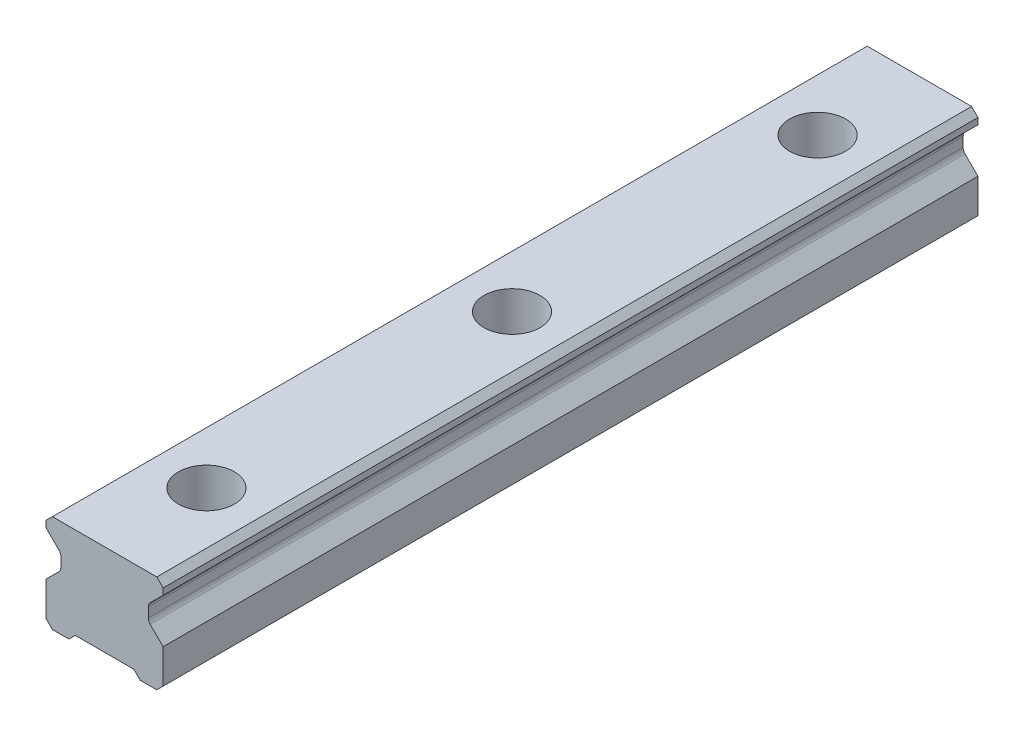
ISO-10303-21;
HEADER;
FILE_DESCRIPTION(('STEP AP214'),'2;1');
FILE_NAME('part.step','',(''),(''),'','','');
FILE_SCHEMA(('AUTOMOTIVE_DESIGN { 1 0 10303 214 1 1 1 1 }'));
ENDSEC;
DATA;
#1=APPLICATION_CONTEXT('core data for automotive mechanical design processes');
#2=APPLICATION_PROTOCOL_DEFINITION('international standard','automotive_design',2000,#1);
#3=PRODUCT_CONTEXT('',#1,'mechanical');
#4=PRODUCT('Part','Part','',(#3));
#5=PRODUCT_RELATED_PRODUCT_CATEGORY('part','',(#4));
#6=PRODUCT_DEFINITION_FORMATION('','',#4);
#7=PRODUCT_DEFINITION_CONTEXT('part definition',#1,'design');
#8=PRODUCT_DEFINITION('design','',#6,#7);
#9=PRODUCT_DEFINITION_SHAPE('','',#8);
#10=(LENGTH_UNIT() NAMED_UNIT(*) SI_UNIT(.MILLI.,.METRE.));
#11=(NAMED_UNIT(*) PLANE_ANGLE_UNIT() SI_UNIT($,.RADIAN.));
#12=(NAMED_UNIT(*) SI_UNIT($,.STERADIAN.) SOLID_ANGLE_UNIT());
#13=UNCERTAINTY_MEASURE_WITH_UNIT(LENGTH_MEASURE(1.E-05),#10,'distance_accuracy_value','');
#14=(GEOMETRIC_REPRESENTATION_CONTEXT(3) GLOBAL_UNCERTAINTY_ASSIGNED_CONTEXT((#13)) GLOBAL_UNIT_ASSIGNED_CONTEXT((#10,
#11,#12)) REPRESENTATION_CONTEXT('',''));
#15=CARTESIAN_POINT('',(0.,0.,0.));
#16=DIRECTION('',(0.,0.,1.));
#17=DIRECTION('',(1.,0.,0.));
#18=AXIS2_PLACEMENT_3D('',#15,#16,#17);
#19=CARTESIAN_POINT('',(0.,10.2,-60.));
#20=DIRECTION('',(0.,1.,0.));
#21=DIRECTION('',(0.,0.,1.));
#22=AXIS2_PLACEMENT_3D('',#19,#20,#21);
#23=PLANE('',#22);
#24=CARTESIAN_POINT('',(0.,10.2,-60.));
#25=DIRECTION('',(0.,1.,0.));
#26=DIRECTION('',(0.,0.,1.));
#27=AXIS2_PLACEMENT_3D('',#24,#25,#26);
#28=CIRCLE('',#27,3.5);
#29=CARTESIAN_POINT('',(0.,10.2,-56.5));
#30=VERTEX_POINT('',#29);
#31=EDGE_CURVE('E369',#30,#30,#28,.T.);
#32=ORIENTED_EDGE('',*,*,#31,.F.);
#33=EDGE_LOOP('',(#32));
#34=FACE_BOUND('',#33,.T.);
#35=CARTESIAN_POINT('',(0.,10.2,-60.));
#36=DIRECTION('',(0.,1.,0.));
#37=DIRECTION('',(0.,0.,1.));
#38=AXIS2_PLACEMENT_3D('',#35,#36,#37);
#39=CIRCLE('',#38,5.5);
#40=CARTESIAN_POINT('',(0.,10.2,-54.5));
#41=VERTEX_POINT('',#40);
#42=EDGE_CURVE('E11',#41,#41,#39,.T.);
#43=ORIENTED_EDGE('',*,*,#42,.T.);
#44=EDGE_LOOP('',(#43));
#45=FACE_BOUND('',#44,.T.);
#46=ADVANCED_FACE('F39',(#34,#45),#23,.T.);
#47=CARTESIAN_POINT('',(0.,10.2,-60.));
#48=DIRECTION('',(0.,1.,0.));
#49=DIRECTION('',(0.,0.,1.));
#50=AXIS2_PLACEMENT_3D('',#47,#48,#49);
#51=CYLINDRICAL_SURFACE('',#50,5.5);
#52=ORIENTED_EDGE('',*,*,#42,.F.);
#53=EDGE_LOOP('',(#52));
#54=FACE_BOUND('',#53,.T.);
#55=CARTESIAN_POINT('',(0.,19.2,-60.));
#56=DIRECTION('',(0.,1.,0.));
#57=DIRECTION('',(0.,0.,1.));
#58=AXIS2_PLACEMENT_3D('',#55,#56,#57);
#59=CIRCLE('',#58,5.5);
#60=CARTESIAN_POINT('',(0.,19.2,-54.5));
#61=VERTEX_POINT('',#60);
#62=EDGE_CURVE('E48',#61,#61,#59,.T.);
#63=ORIENTED_EDGE('',*,*,#62,.T.);
#64=EDGE_LOOP('',(#63));
#65=FACE_BOUND('',#64,.T.);
#66=ADVANCED_FACE('F556',(#54,#65),#51,.F.);
#67=CARTESIAN_POINT('',(11.5,0.,80.));
#68=DIRECTION('',(0.,1.,0.));
#69=DIRECTION('',(-1.,0.,0.));
#70=AXIS2_PLACEMENT_3D('',#67,#68,#69);
#71=PLANE('',#70);
#72=DIRECTION('',(1.,0.,0.));
#73=VECTOR('',#72,1.);
#74=CARTESIAN_POINT('',(11.5,0.,-80.));
#75=LINE('',#74,#73);
#76=CARTESIAN_POINT('',(-10.25,0.,-80.));
#77=VERTEX_POINT('',#76);
#78=CARTESIAN_POINT('',(-7.,0.,-80.));
#79=VERTEX_POINT('',#78);
#80=EDGE_CURVE('E229',#77,#79,#75,.T.);
#81=ORIENTED_EDGE('',*,*,#80,.T.);
#82=DIRECTION('',(0.,0.,1.));
#83=VECTOR('',#82,1.);
#84=CARTESIAN_POINT('',(-7.,0.,-80.));
#85=LINE('',#84,#83);
#86=CARTESIAN_POINT('',(-7.,0.,80.));
#87=VERTEX_POINT('',#86);
#88=EDGE_CURVE('E411',#79,#87,#85,.T.);
#89=ORIENTED_EDGE('',*,*,#88,.T.);
#90=DIRECTION('',(1.,0.,0.));
#91=VECTOR('',#90,1.);
#92=CARTESIAN_POINT('',(11.5,0.,80.));
#93=LINE('',#92,#91);
#94=CARTESIAN_POINT('',(-10.25,0.,80.));
#95=VERTEX_POINT('',#94);
#96=EDGE_CURVE('E481',#95,#87,#93,.T.);
#97=ORIENTED_EDGE('',*,*,#96,.F.);
#98=DIRECTION('',(0.,0.,-1.));
#99=VECTOR('',#98,1.);
#100=CARTESIAN_POINT('',(-10.25,0.,80.));
#101=LINE('',#100,#99);
#102=EDGE_CURVE('E289',#95,#77,#101,.T.);
#103=ORIENTED_EDGE('',*,*,#102,.T.);
#104=EDGE_LOOP('',(#81,#89,#97,#103));
#105=FACE_BOUND('',#104,.T.);
#106=ADVANCED_FACE('F558',(#105),#71,.F.);
#107=CARTESIAN_POINT('',(-11.5,19.2,80.));
#108=DIRECTION('',(1.,0.,0.));
#109=DIRECTION('',(0.,1.,0.));
#110=AXIS2_PLACEMENT_3D('',#107,#108,#109);
#111=PLANE('',#110);
#112=DIRECTION('',(0.,-1.,0.));
#113=VECTOR('',#112,1.);
#114=CARTESIAN_POINT('',(-11.5,19.2,80.));
#115=LINE('',#114,#113);
#116=CARTESIAN_POINT('',(-11.5,17.95,80.));
#117=VERTEX_POINT('',#116);
#118=CARTESIAN_POINT('',(-11.5,16.7,80.));
#119=VERTEX_POINT('',#118);
#120=EDGE_CURVE('E477',#117,#119,#115,.T.);
#121=ORIENTED_EDGE('',*,*,#120,.F.);
#122=DIRECTION('',(0.,0.,-1.));
#123=VECTOR('',#122,1.);
#124=CARTESIAN_POINT('',(-11.5,17.95,80.));
#125=LINE('',#124,#123);
#126=CARTESIAN_POINT('',(-11.5,17.95,-80.));
#127=VERTEX_POINT('',#126);
#128=EDGE_CURVE('E252',#117,#127,#125,.T.);
#129=ORIENTED_EDGE('',*,*,#128,.T.);
#130=DIRECTION('',(0.,-1.,0.));
#131=VECTOR('',#130,1.);
#132=CARTESIAN_POINT('',(-11.5,19.2,-80.));
#133=LINE('',#132,#131);
#134=CARTESIAN_POINT('',(-11.5,16.7,-80.));
#135=VERTEX_POINT('',#134);
#136=EDGE_CURVE('E230',#127,#135,#133,.T.);
#137=ORIENTED_EDGE('',*,*,#136,.T.);
#138=DIRECTION('',(0.,0.,1.));
#139=VECTOR('',#138,1.);
#140=CARTESIAN_POINT('',(-11.5,16.7,-80.));
#141=LINE('',#140,#139);
#142=EDGE_CURVE('E432',#135,#119,#141,.T.);
#143=ORIENTED_EDGE('',*,*,#142,.T.);
#144=EDGE_LOOP('',(#121,#129,#137,#143));
#145=FACE_BOUND('',#144,.T.);
#146=ADVANCED_FACE('F507',(#145),#111,.F.);
#147=CARTESIAN_POINT('',(11.5,19.2,80.));
#148=DIRECTION('',(-1.,0.,0.));
#149=DIRECTION('',(0.,0.,1.));
#150=AXIS2_PLACEMENT_3D('',#147,#148,#149);
#151=PLANE('',#150);
#152=DIRECTION('',(0.,1.,0.));
#153=VECTOR('',#152,1.);
#154=CARTESIAN_POINT('',(11.5,19.2,80.));
#155=LINE('',#154,#153);
#156=CARTESIAN_POINT('',(11.5,1.25,80.));
#157=VERTEX_POINT('',#156);
#158=CARTESIAN_POINT('',(11.5,7.95,80.));
#159=VERTEX_POINT('',#158);
#160=EDGE_CURVE('E486',#157,#159,#155,.T.);
#161=ORIENTED_EDGE('',*,*,#160,.F.);
#162=DIRECTION('',(0.,0.,-1.));
#163=VECTOR('',#162,1.);
#164=CARTESIAN_POINT('',(11.5,1.25,80.));
#165=LINE('',#164,#163);
#166=CARTESIAN_POINT('',(11.5,1.25,-80.));
#167=VERTEX_POINT('',#166);
#168=EDGE_CURVE('E296',#157,#167,#165,.T.);
#169=ORIENTED_EDGE('',*,*,#168,.T.);
#170=DIRECTION('',(0.,1.,0.));
#171=VECTOR('',#170,1.);
#172=CARTESIAN_POINT('',(11.5,19.2,-80.));
#173=LINE('',#172,#171);
#174=CARTESIAN_POINT('',(11.5,7.95,-80.));
#175=VERTEX_POINT('',#174);
#176=EDGE_CURVE('E243',#167,#175,#173,.T.);
#177=ORIENTED_EDGE('',*,*,#176,.T.);
#178=DIRECTION('',(0.,0.,1.));
#179=VECTOR('',#178,1.);
#180=CARTESIAN_POINT('',(11.5,7.95,-80.));
#181=LINE('',#180,#179);
#182=EDGE_CURVE('E462',#175,#159,#181,.T.);
#183=ORIENTED_EDGE('',*,*,#182,.T.);
#184=EDGE_LOOP('',(#161,#169,#177,#183));
#185=FACE_BOUND('',#184,.T.);
#186=ADVANCED_FACE('F595',(#185),#151,.F.);
#187=CARTESIAN_POINT('',(-11.5,7.95,-80.));
#188=VERTEX_POINT('',#187);
#189=CARTESIAN_POINT('',(-11.5,1.24999999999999,-80.));
#190=VERTEX_POINT('',#189);
#191=EDGE_CURVE('E239',#188,#190,#133,.T.);
#192=ORIENTED_EDGE('',*,*,#191,.T.);
#193=DIRECTION('',(0.,0.,1.));
#194=VECTOR('',#193,1.);
#195=CARTESIAN_POINT('',(-11.5,1.24999999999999,80.));
#196=LINE('',#195,#194);
#197=CARTESIAN_POINT('',(-11.5,1.24999999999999,80.));
#198=VERTEX_POINT('',#197);
#199=EDGE_CURVE('E293',#190,#198,#196,.T.);
#200=ORIENTED_EDGE('',*,*,#199,.T.);
#201=CARTESIAN_POINT('',(-11.5,7.95,80.));
#202=VERTEX_POINT('',#201);
#203=EDGE_CURVE('E251',#202,#198,#115,.T.);
#204=ORIENTED_EDGE('',*,*,#203,.F.);
#205=DIRECTION('',(0.,0.,1.));
#206=VECTOR('',#205,1.);
#207=CARTESIAN_POINT('',(-11.5,7.95,-80.));
#208=LINE('',#207,#206);
#209=EDGE_CURVE('E444',#188,#202,#208,.T.);
#210=ORIENTED_EDGE('',*,*,#209,.F.);
#211=EDGE_LOOP('',(#192,#200,#204,#210));
#212=FACE_BOUND('',#211,.T.);
#213=ADVANCED_FACE('F535',(#212),#111,.F.);
#214=CARTESIAN_POINT('',(7.,0.,80.));
#215=VERTEX_POINT('',#214);
#216=CARTESIAN_POINT('',(10.25,0.,80.));
#217=VERTEX_POINT('',#216);
#218=EDGE_CURVE('E219',#215,#217,#93,.T.);
#219=ORIENTED_EDGE('',*,*,#218,.F.);
#220=DIRECTION('',(0.,0.,1.));
#221=VECTOR('',#220,1.);
#222=CARTESIAN_POINT('',(7.,0.,-80.));
#223=LINE('',#222,#221);
#224=CARTESIAN_POINT('',(7.,0.,-80.));
#225=VERTEX_POINT('',#224);
#226=EDGE_CURVE('E206',#225,#215,#223,.T.);
#227=ORIENTED_EDGE('',*,*,#226,.F.);
#228=CARTESIAN_POINT('',(10.25,0.,-80.));
#229=VERTEX_POINT('',#228);
#230=EDGE_CURVE('E217',#225,#229,#75,.T.);
#231=ORIENTED_EDGE('',*,*,#230,.T.);
#232=DIRECTION('',(0.,0.,1.));
#233=VECTOR('',#232,1.);
#234=CARTESIAN_POINT('',(10.25,0.,80.));
#235=LINE('',#234,#233);
#236=EDGE_CURVE('E286',#229,#217,#235,.T.);
#237=ORIENTED_EDGE('',*,*,#236,.T.);
#238=EDGE_LOOP('',(#219,#227,#231,#237));
#239=FACE_BOUND('',#238,.T.);
#240=ADVANCED_FACE('F215',(#239),#71,.F.);
#241=CARTESIAN_POINT('',(11.5,16.7,-80.));
#242=VERTEX_POINT('',#241);
#243=CARTESIAN_POINT('',(11.5,17.95,-80.));
#244=VERTEX_POINT('',#243);
#245=EDGE_CURVE('E236',#242,#244,#173,.T.);
#246=ORIENTED_EDGE('',*,*,#245,.T.);
#247=DIRECTION('',(0.,0.,1.));
#248=VECTOR('',#247,1.);
#249=CARTESIAN_POINT('',(11.5,17.95,80.));
#250=LINE('',#249,#248);
#251=CARTESIAN_POINT('',(11.5,17.95,80.));
#252=VERTEX_POINT('',#251);
#253=EDGE_CURVE('E300',#244,#252,#250,.T.);
#254=ORIENTED_EDGE('',*,*,#253,.T.);
#255=CARTESIAN_POINT('',(11.5,16.7,80.));
#256=VERTEX_POINT('',#255);
#257=EDGE_CURVE('E485',#256,#252,#155,.T.);
#258=ORIENTED_EDGE('',*,*,#257,.F.);
#259=DIRECTION('',(0.,0.,1.));
#260=VECTOR('',#259,1.);
#261=CARTESIAN_POINT('',(11.5,16.7,-80.));
#262=LINE('',#261,#260);
#263=EDGE_CURVE('E437',#242,#256,#262,.T.);
#264=ORIENTED_EDGE('',*,*,#263,.F.);
#265=EDGE_LOOP('',(#246,#254,#258,#264));
#266=FACE_BOUND('',#265,.T.);
#267=ADVANCED_FACE('F545',(#266),#151,.F.);
#268=CARTESIAN_POINT('',(11.5,19.2,80.));
#269=DIRECTION('',(0.,-1.,0.));
#270=DIRECTION('',(0.,0.,-1.));
#271=AXIS2_PLACEMENT_3D('',#268,#269,#270);
#272=PLANE('',#271);
#273=CARTESIAN_POINT('',(0.,19.2,0.));
#274=DIRECTION('',(0.,1.,0.));
#275=DIRECTION('',(0.,0.,1.));
#276=AXIS2_PLACEMENT_3D('',#273,#274,#275);
#277=CIRCLE('',#276,5.5);
#278=CARTESIAN_POINT('',(0.,19.2,5.5));
#279=VERTEX_POINT('',#278);
#280=EDGE_CURVE('E374',#279,#279,#277,.T.);
#281=ORIENTED_EDGE('',*,*,#280,.F.);
#282=EDGE_LOOP('',(#281));
#283=FACE_BOUND('',#282,.T.);
#284=CARTESIAN_POINT('',(0.,19.2,60.));
#285=DIRECTION('',(0.,1.,0.));
#286=DIRECTION('',(0.,0.,1.));
#287=AXIS2_PLACEMENT_3D('',#284,#285,#286);
#288=CIRCLE('',#287,5.5);
#289=CARTESIAN_POINT('',(0.,19.2,65.5));
#290=VERTEX_POINT('',#289);
#291=EDGE_CURVE('E390',#290,#290,#288,.T.);
#292=ORIENTED_EDGE('',*,*,#291,.F.);
#293=EDGE_LOOP('',(#292));
#294=FACE_BOUND('',#293,.T.);
#295=DIRECTION('',(-1.,0.,0.));
#296=VECTOR('',#295,1.);
#297=CARTESIAN_POINT('',(11.5,19.2,-80.));
#298=LINE('',#297,#296);
#299=CARTESIAN_POINT('',(10.25,19.2,-80.));
#300=VERTEX_POINT('',#299);
#301=CARTESIAN_POINT('',(-10.25,19.2,-80.));
#302=VERTEX_POINT('',#301);
#303=EDGE_CURVE('E247',#300,#302,#298,.T.);
#304=ORIENTED_EDGE('',*,*,#303,.T.);
#305=DIRECTION('',(0.,0.,1.));
#306=VECTOR('',#305,1.);
#307=CARTESIAN_POINT('',(-10.25,19.2,80.));
#308=LINE('',#307,#306);
#309=CARTESIAN_POINT('',(-10.25,19.2,80.));
#310=VERTEX_POINT('',#309);
#311=EDGE_CURVE('E272',#302,#310,#308,.T.);
#312=ORIENTED_EDGE('',*,*,#311,.T.);
#313=DIRECTION('',(-1.,0.,0.));
#314=VECTOR('',#313,1.);
#315=CARTESIAN_POINT('',(11.5,19.2,80.));
#316=LINE('',#315,#314);
#317=CARTESIAN_POINT('',(10.25,19.2,80.));
#318=VERTEX_POINT('',#317);
#319=EDGE_CURVE('E257',#318,#310,#316,.T.);
#320=ORIENTED_EDGE('',*,*,#319,.F.);
#321=DIRECTION('',(0.,0.,-1.));
#322=VECTOR('',#321,1.);
#323=CARTESIAN_POINT('',(10.25,19.2,80.));
#324=LINE('',#323,#322);
#325=EDGE_CURVE('E268',#318,#300,#324,.T.);
#326=ORIENTED_EDGE('',*,*,#325,.T.);
#327=EDGE_LOOP('',(#304,#312,#320,#326));
#328=FACE_BOUND('',#327,.T.);
#329=ORIENTED_EDGE('',*,*,#62,.F.);
#330=EDGE_LOOP('',(#329));
#331=FACE_BOUND('',#330,.T.);
#332=ADVANCED_FACE('F549',(#283,#294,#328,#331),#272,.F.);
#333=CARTESIAN_POINT('',(0.,0.,80.));
#334=DIRECTION('',(0.,0.,-1.));
#335=DIRECTION('',(-1.,0.,0.));
#336=AXIS2_PLACEMENT_3D('',#333,#334,#335);
#337=PLANE('',#336);
#338=ORIENTED_EDGE('',*,*,#96,.T.);
#339=DIRECTION('',(-0.707106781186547,-0.707106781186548,0.));
#340=VECTOR('',#339,1.);
#341=CARTESIAN_POINT('',(-7.,0.,80.));
#342=LINE('',#341,#340);
#343=CARTESIAN_POINT('',(-5.75,1.25,80.));
#344=VERTEX_POINT('',#343);
#345=EDGE_CURVE('E211',#344,#87,#342,.T.);
#346=ORIENTED_EDGE('',*,*,#345,.F.);
#347=DIRECTION('',(-1.,0.,0.));
#348=VECTOR('',#347,1.);
#349=CARTESIAN_POINT('',(-5.75,1.25,80.));
#350=LINE('',#349,#348);
#351=CARTESIAN_POINT('',(5.75,1.25,80.));
#352=VERTEX_POINT('',#351);
#353=EDGE_CURVE('E405',#352,#344,#350,.T.);
#354=ORIENTED_EDGE('',*,*,#353,.F.);
#355=DIRECTION('',(-0.707106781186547,0.707106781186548,0.));
#356=VECTOR('',#355,1.);
#357=CARTESIAN_POINT('',(5.75,1.25,80.));
#358=LINE('',#357,#356);
#359=EDGE_CURVE('E395',#215,#352,#358,.T.);
#360=ORIENTED_EDGE('',*,*,#359,.F.);
#361=ORIENTED_EDGE('',*,*,#218,.T.);
#362=DIRECTION('',(-0.707106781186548,-0.707106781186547,0.));
#363=VECTOR('',#362,1.);
#364=CARTESIAN_POINT('',(11.5,1.25,80.));
#365=LINE('',#364,#363);
#366=EDGE_CURVE('E278',#217,#157,#365,.F.);
#367=ORIENTED_EDGE('',*,*,#366,.T.);
#368=ORIENTED_EDGE('',*,*,#160,.T.);
#369=DIRECTION('',(0.707106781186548,-0.707106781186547,0.));
#370=VECTOR('',#369,1.);
#371=CARTESIAN_POINT('',(11.5,7.95,80.));
#372=LINE('',#371,#370);
#373=CARTESIAN_POINT('',(8.94944985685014,10.5005501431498,80.));
#374=VERTEX_POINT('',#373);
#375=EDGE_CURVE('E415',#374,#159,#372,.T.);
#376=ORIENTED_EDGE('',*,*,#375,.F.);
#377=CARTESIAN_POINT('',(9.83333333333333,11.384433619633,80.));
#378=DIRECTION('',(0.,0.,-1.));
#379=DIRECTION('',(-1.,0.,0.));
#380=AXIS2_PLACEMENT_3D('',#377,#378,#379);
#381=CIRCLE('',#380,1.25);
#382=CARTESIAN_POINT('',(8.58333333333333,11.384433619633,80.));
#383=VERTEX_POINT('',#382);
#384=EDGE_CURVE('E331',#374,#383,#381,.T.);
#385=ORIENTED_EDGE('',*,*,#384,.T.);
#386=DIRECTION('',(0.,-1.,0.));
#387=VECTOR('',#386,1.);
#388=CARTESIAN_POINT('',(8.58333333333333,10.8666666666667,80.));
#389=LINE('',#388,#387);
#390=CARTESIAN_POINT('',(8.58333333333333,13.265566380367,80.));
#391=VERTEX_POINT('',#390);
#392=EDGE_CURVE('E454',#391,#383,#389,.T.);
#393=ORIENTED_EDGE('',*,*,#392,.F.);
#394=CARTESIAN_POINT('',(9.83333333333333,13.265566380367,80.));
#395=DIRECTION('',(0.,0.,-1.));
#396=DIRECTION('',(-1.,0.,0.));
#397=AXIS2_PLACEMENT_3D('',#394,#395,#396);
#398=CIRCLE('',#397,1.25);
#399=CARTESIAN_POINT('',(8.94944985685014,14.1494498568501,80.));
#400=VERTEX_POINT('',#399);
#401=EDGE_CURVE('E337',#391,#400,#398,.T.);
#402=ORIENTED_EDGE('',*,*,#401,.T.);
#403=DIRECTION('',(-0.707106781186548,-0.707106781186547,0.));
#404=VECTOR('',#403,1.);
#405=CARTESIAN_POINT('',(8.58333333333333,13.7833333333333,80.));
#406=LINE('',#405,#404);
#407=EDGE_CURVE('E465',#256,#400,#406,.T.);
#408=ORIENTED_EDGE('',*,*,#407,.F.);
#409=ORIENTED_EDGE('',*,*,#257,.T.);
#410=DIRECTION('',(0.707106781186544,-0.707106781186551,0.));
#411=VECTOR('',#410,1.);
#412=CARTESIAN_POINT('',(10.25,19.2,80.));
#413=LINE('',#412,#411);
#414=EDGE_CURVE('E275',#252,#318,#413,.F.);
#415=ORIENTED_EDGE('',*,*,#414,.T.);
#416=ORIENTED_EDGE('',*,*,#319,.T.);
#417=DIRECTION('',(0.707106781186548,0.707106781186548,0.));
#418=VECTOR('',#417,1.);
#419=CARTESIAN_POINT('',(-11.5,17.95,80.));
#420=LINE('',#419,#418);
#421=EDGE_CURVE('E284',#310,#117,#420,.F.);
#422=ORIENTED_EDGE('',*,*,#421,.T.);
#423=ORIENTED_EDGE('',*,*,#120,.T.);
#424=DIRECTION('',(-0.707106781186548,0.707106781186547,0.));
#425=VECTOR('',#424,1.);
#426=CARTESIAN_POINT('',(-8.58333333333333,13.7833333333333,80.));
#427=LINE('',#426,#425);
#428=CARTESIAN_POINT('',(-8.94944985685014,14.1494498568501,80.));
#429=VERTEX_POINT('',#428);
#430=EDGE_CURVE('E433',#429,#119,#427,.T.);
#431=ORIENTED_EDGE('',*,*,#430,.F.);
#432=CARTESIAN_POINT('',(-9.83333333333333,13.265566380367,80.));
#433=DIRECTION('',(0.,0.,-1.));
#434=DIRECTION('',(-1.,0.,0.));
#435=AXIS2_PLACEMENT_3D('',#432,#433,#434);
#436=CIRCLE('',#435,1.25);
#437=CARTESIAN_POINT('',(-8.58333333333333,13.265566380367,80.));
#438=VERTEX_POINT('',#437);
#439=EDGE_CURVE('E349',#429,#438,#436,.T.);
#440=ORIENTED_EDGE('',*,*,#439,.T.);
#441=DIRECTION('',(0.,1.,0.));
#442=VECTOR('',#441,1.);
#443=CARTESIAN_POINT('',(-8.58333333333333,10.8666666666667,80.));
#444=LINE('',#443,#442);
#445=CARTESIAN_POINT('',(-8.58333333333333,11.384433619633,80.));
#446=VERTEX_POINT('',#445);
#447=EDGE_CURVE('E425',#446,#438,#444,.T.);
#448=ORIENTED_EDGE('',*,*,#447,.F.);
#449=CARTESIAN_POINT('',(-9.83333333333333,11.384433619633,80.));
#450=DIRECTION('',(0.,0.,-1.));
#451=DIRECTION('',(-1.,0.,0.));
#452=AXIS2_PLACEMENT_3D('',#449,#450,#451);
#453=CIRCLE('',#452,1.25);
#454=CARTESIAN_POINT('',(-8.94944985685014,10.5005501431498,80.));
#455=VERTEX_POINT('',#454);
#456=EDGE_CURVE('E343',#446,#455,#453,.T.);
#457=ORIENTED_EDGE('',*,*,#456,.T.);
#458=DIRECTION('',(0.707106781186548,0.707106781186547,0.));
#459=VECTOR('',#458,1.);
#460=CARTESIAN_POINT('',(-11.5,7.95,80.));
#461=LINE('',#460,#459);
#462=EDGE_CURVE('E436',#202,#455,#461,.T.);
#463=ORIENTED_EDGE('',*,*,#462,.F.);
#464=ORIENTED_EDGE('',*,*,#203,.T.);
#465=DIRECTION('',(-0.707106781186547,0.707106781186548,0.));
#466=VECTOR('',#465,1.);
#467=CARTESIAN_POINT('',(-10.25,0.,80.));
#468=LINE('',#467,#466);
#469=EDGE_CURVE('E281',#198,#95,#468,.F.);
#470=ORIENTED_EDGE('',*,*,#469,.T.);
#471=EDGE_LOOP('',(#338,#346,#354,#360,#361,#367,#368,#376,#385,#393,#402,#408,#409,#415,#416,
#422,#423,#431,#440,#448,#457,#463,#464,#470));
#472=FACE_BOUND('',#471,.T.);
#473=ADVANCED_FACE('F495',(#472),#337,.F.);
#474=CARTESIAN_POINT('',(0.,0.,-80.));
#475=DIRECTION('',(0.,0.,-1.));
#476=DIRECTION('',(-1.,0.,0.));
#477=AXIS2_PLACEMENT_3D('',#474,#475,#476);
#478=PLANE('',#477);
#479=DIRECTION('',(-0.707106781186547,-0.707106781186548,0.));
#480=VECTOR('',#479,1.);
#481=CARTESIAN_POINT('',(-7.,0.,-80.));
#482=LINE('',#481,#480);
#483=CARTESIAN_POINT('',(-5.75,1.25,-80.));
#484=VERTEX_POINT('',#483);
#485=EDGE_CURVE('E221',#484,#79,#482,.T.);
#486=ORIENTED_EDGE('',*,*,#485,.T.);
#487=ORIENTED_EDGE('',*,*,#80,.F.);
#488=DIRECTION('',(0.707106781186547,-0.707106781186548,0.));
#489=VECTOR('',#488,1.);
#490=CARTESIAN_POINT('',(-5.12500000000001,-5.12500000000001,-80.));
#491=LINE('',#490,#489);
#492=EDGE_CURVE('E262',#77,#190,#491,.F.);
#493=ORIENTED_EDGE('',*,*,#492,.T.);
#494=ORIENTED_EDGE('',*,*,#191,.F.);
#495=DIRECTION('',(0.707106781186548,0.707106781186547,0.));
#496=VECTOR('',#495,1.);
#497=CARTESIAN_POINT('',(-11.5,7.95,-80.));
#498=LINE('',#497,#496);
#499=CARTESIAN_POINT('',(-8.94944985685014,10.5005501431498,-80.));
#500=VERTEX_POINT('',#499);
#501=EDGE_CURVE('E424',#188,#500,#498,.T.);
#502=ORIENTED_EDGE('',*,*,#501,.T.);
#503=CARTESIAN_POINT('',(-9.83333333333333,11.384433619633,-80.));
#504=DIRECTION('',(0.,0.,-1.));
#505=DIRECTION('',(-1.,0.,0.));
#506=AXIS2_PLACEMENT_3D('',#503,#504,#505);
#507=CIRCLE('',#506,1.25);
#508=CARTESIAN_POINT('',(-8.58333333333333,11.384433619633,-80.));
#509=VERTEX_POINT('',#508);
#510=EDGE_CURVE('E346',#500,#509,#507,.F.);
#511=ORIENTED_EDGE('',*,*,#510,.T.);
#512=DIRECTION('',(0.,1.,0.));
#513=VECTOR('',#512,1.);
#514=CARTESIAN_POINT('',(-8.58333333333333,10.8666666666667,-80.));
#515=LINE('',#514,#513);
#516=CARTESIAN_POINT('',(-8.58333333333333,13.265566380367,-80.));
#517=VERTEX_POINT('',#516);
#518=EDGE_CURVE('E429',#509,#517,#515,.T.);
#519=ORIENTED_EDGE('',*,*,#518,.T.);
#520=CARTESIAN_POINT('',(-9.83333333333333,13.265566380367,-80.));
#521=DIRECTION('',(0.,0.,-1.));
#522=DIRECTION('',(-1.,0.,0.));
#523=AXIS2_PLACEMENT_3D('',#520,#521,#522);
#524=CIRCLE('',#523,1.25);
#525=CARTESIAN_POINT('',(-8.94944985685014,14.1494498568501,-80.));
#526=VERTEX_POINT('',#525);
#527=EDGE_CURVE('E64',#517,#526,#524,.F.);
#528=ORIENTED_EDGE('',*,*,#527,.T.);
#529=DIRECTION('',(-0.707106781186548,0.707106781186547,0.));
#530=VECTOR('',#529,1.);
#531=CARTESIAN_POINT('',(-8.58333333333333,13.7833333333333,-80.));
#532=LINE('',#531,#530);
#533=EDGE_CURVE('E421',#526,#135,#532,.T.);
#534=ORIENTED_EDGE('',*,*,#533,.T.);
#535=ORIENTED_EDGE('',*,*,#136,.F.);
#536=DIRECTION('',(-0.707106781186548,-0.707106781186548,0.));
#537=VECTOR('',#536,1.);
#538=CARTESIAN_POINT('',(-14.725,14.725,-80.));
#539=LINE('',#538,#537);
#540=EDGE_CURVE('E265',#127,#302,#539,.F.);
#541=ORIENTED_EDGE('',*,*,#540,.T.);
#542=ORIENTED_EDGE('',*,*,#303,.F.);
#543=DIRECTION('',(-0.707106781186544,0.707106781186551,0.));
#544=VECTOR('',#543,1.);
#545=CARTESIAN_POINT('',(14.725,14.7249999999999,-80.));
#546=LINE('',#545,#544);
#547=EDGE_CURVE('E256',#300,#244,#546,.F.);
#548=ORIENTED_EDGE('',*,*,#547,.T.);
#549=ORIENTED_EDGE('',*,*,#245,.F.);
#550=DIRECTION('',(-0.707106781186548,-0.707106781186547,0.));
#551=VECTOR('',#550,1.);
#552=CARTESIAN_POINT('',(8.58333333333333,13.7833333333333,-80.));
#553=LINE('',#552,#551);
#554=CARTESIAN_POINT('',(8.94944985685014,14.1494498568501,-80.));
#555=VERTEX_POINT('',#554);
#556=EDGE_CURVE('E453',#242,#555,#553,.T.);
#557=ORIENTED_EDGE('',*,*,#556,.T.);
#558=CARTESIAN_POINT('',(9.83333333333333,13.265566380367,-80.));
#559=DIRECTION('',(0.,0.,-1.));
#560=DIRECTION('',(-1.,0.,0.));
#561=AXIS2_PLACEMENT_3D('',#558,#559,#560);
#562=CIRCLE('',#561,1.25);
#563=CARTESIAN_POINT('',(8.58333333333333,13.265566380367,-80.));
#564=VERTEX_POINT('',#563);
#565=EDGE_CURVE('E340',#555,#564,#562,.F.);
#566=ORIENTED_EDGE('',*,*,#565,.T.);
#567=DIRECTION('',(0.,-1.,0.));
#568=VECTOR('',#567,1.);
#569=CARTESIAN_POINT('',(8.58333333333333,10.8666666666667,-80.));
#570=LINE('',#569,#568);
#571=CARTESIAN_POINT('',(8.58333333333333,11.384433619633,-80.));
#572=VERTEX_POINT('',#571);
#573=EDGE_CURVE('E458',#564,#572,#570,.T.);
#574=ORIENTED_EDGE('',*,*,#573,.T.);
#575=CARTESIAN_POINT('',(9.83333333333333,11.384433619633,-80.));
#576=DIRECTION('',(0.,0.,-1.));
#577=DIRECTION('',(-1.,0.,0.));
#578=AXIS2_PLACEMENT_3D('',#575,#576,#577);
#579=CIRCLE('',#578,1.25);
#580=CARTESIAN_POINT('',(8.94944985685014,10.5005501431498,-80.));
#581=VERTEX_POINT('',#580);
#582=EDGE_CURVE('E334',#572,#581,#579,.F.);
#583=ORIENTED_EDGE('',*,*,#582,.T.);
#584=DIRECTION('',(0.707106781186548,-0.707106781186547,0.));
#585=VECTOR('',#584,1.);
#586=CARTESIAN_POINT('',(11.5,7.95,-80.));
#587=LINE('',#586,#585);
#588=EDGE_CURVE('E450',#581,#175,#587,.T.);
#589=ORIENTED_EDGE('',*,*,#588,.T.);
#590=ORIENTED_EDGE('',*,*,#176,.F.);
#591=DIRECTION('',(0.707106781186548,0.707106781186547,0.));
#592=VECTOR('',#591,1.);
#593=CARTESIAN_POINT('',(5.12499999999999,-5.125,-80.));
#594=LINE('',#593,#592);
#595=EDGE_CURVE('E226',#167,#229,#594,.F.);
#596=ORIENTED_EDGE('',*,*,#595,.T.);
#597=ORIENTED_EDGE('',*,*,#230,.F.);
#598=DIRECTION('',(-0.707106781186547,0.707106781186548,0.));
#599=VECTOR('',#598,1.);
#600=CARTESIAN_POINT('',(5.75,1.25,-80.));
#601=LINE('',#600,#599);
#602=CARTESIAN_POINT('',(5.75,1.25,-80.));
#603=VERTEX_POINT('',#602);
#604=EDGE_CURVE('E202',#225,#603,#601,.T.);
#605=ORIENTED_EDGE('',*,*,#604,.T.);
#606=DIRECTION('',(-1.,0.,0.));
#607=VECTOR('',#606,1.);
#608=CARTESIAN_POINT('',(-5.75,1.25,-80.));
#609=LINE('',#608,#607);
#610=EDGE_CURVE('E56',#603,#484,#609,.T.);
#611=ORIENTED_EDGE('',*,*,#610,.T.);
#612=EDGE_LOOP('',(#486,#487,#493,#494,#502,#511,#519,#528,#534,#535,#541,#542,#548,#549,#557,
#566,#574,#583,#589,#590,#596,#597,#605,#611));
#613=FACE_BOUND('',#612,.T.);
#614=ADVANCED_FACE('F224',(#613),#478,.T.);
#615=CARTESIAN_POINT('',(11.5,7.95,-80.));
#616=DIRECTION('',(-0.707106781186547,-0.707106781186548,0.));
#617=DIRECTION('',(0.707106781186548,-0.707106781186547,0.));
#618=AXIS2_PLACEMENT_3D('',#615,#616,#617);
#619=PLANE('',#618);
#620=ORIENTED_EDGE('',*,*,#588,.F.);
#621=DIRECTION('',(0.,0.,1.));
#622=VECTOR('',#621,1.);
#623=CARTESIAN_POINT('',(8.94944985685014,10.5005501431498,80.));
#624=LINE('',#623,#622);
#625=EDGE_CURVE('E303',#581,#374,#624,.T.);
#626=ORIENTED_EDGE('',*,*,#625,.T.);
#627=ORIENTED_EDGE('',*,*,#375,.T.);
#628=ORIENTED_EDGE('',*,*,#182,.F.);
#629=EDGE_LOOP('',(#620,#626,#627,#628));
#630=FACE_BOUND('',#629,.T.);
#631=ADVANCED_FACE('F602',(#630),#619,.F.);
#632=CARTESIAN_POINT('',(8.58333333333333,10.8666666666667,-80.));
#633=DIRECTION('',(-1.,0.,0.));
#634=DIRECTION('',(0.,0.,1.));
#635=AXIS2_PLACEMENT_3D('',#632,#633,#634);
#636=PLANE('',#635);
#637=ORIENTED_EDGE('',*,*,#392,.T.);
#638=DIRECTION('',(0.,0.,1.));
#639=VECTOR('',#638,1.);
#640=CARTESIAN_POINT('',(8.58333333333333,11.384433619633,-80.));
#641=LINE('',#640,#639);
#642=EDGE_CURVE('E311',#383,#572,#641,.F.);
#643=ORIENTED_EDGE('',*,*,#642,.T.);
#644=ORIENTED_EDGE('',*,*,#573,.F.);
#645=DIRECTION('',(0.,0.,1.));
#646=VECTOR('',#645,1.);
#647=CARTESIAN_POINT('',(8.58333333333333,13.265566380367,80.));
#648=LINE('',#647,#646);
#649=EDGE_CURVE('E307',#564,#391,#648,.T.);
#650=ORIENTED_EDGE('',*,*,#649,.T.);
#651=EDGE_LOOP('',(#637,#643,#644,#650));
#652=FACE_BOUND('',#651,.T.);
#653=ADVANCED_FACE('F607',(#652),#636,.F.);
#654=CARTESIAN_POINT('',(8.58333333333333,13.7833333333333,-80.));
#655=DIRECTION('',(-0.707106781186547,0.707106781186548,0.));
#656=DIRECTION('',(-0.707106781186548,-0.707106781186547,0.));
#657=AXIS2_PLACEMENT_3D('',#654,#655,#656);
#658=PLANE('',#657);
#659=ORIENTED_EDGE('',*,*,#407,.T.);
#660=DIRECTION('',(0.,0.,1.));
#661=VECTOR('',#660,1.);
#662=CARTESIAN_POINT('',(8.94944985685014,14.1494498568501,-80.));
#663=LINE('',#662,#661);
#664=EDGE_CURVE('E314',#400,#555,#663,.F.);
#665=ORIENTED_EDGE('',*,*,#664,.T.);
#666=ORIENTED_EDGE('',*,*,#556,.F.);
#667=ORIENTED_EDGE('',*,*,#263,.T.);
#668=EDGE_LOOP('',(#659,#665,#666,#667));
#669=FACE_BOUND('',#668,.T.);
#670=ADVANCED_FACE('F609',(#669),#658,.F.);
#671=CARTESIAN_POINT('',(-8.58333333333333,13.7833333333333,-80.));
#672=DIRECTION('',(0.707106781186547,0.707106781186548,0.));
#673=DIRECTION('',(-0.707106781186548,0.707106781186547,0.));
#674=AXIS2_PLACEMENT_3D('',#671,#672,#673);
#675=PLANE('',#674);
#676=ORIENTED_EDGE('',*,*,#533,.F.);
#677=DIRECTION('',(0.,0.,1.));
#678=VECTOR('',#677,1.);
#679=CARTESIAN_POINT('',(-8.94944985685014,14.1494498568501,80.));
#680=LINE('',#679,#678);
#681=EDGE_CURVE('E327',#526,#429,#680,.T.);
#682=ORIENTED_EDGE('',*,*,#681,.T.);
#683=ORIENTED_EDGE('',*,*,#430,.T.);
#684=ORIENTED_EDGE('',*,*,#142,.F.);
#685=EDGE_LOOP('',(#676,#682,#683,#684));
#686=FACE_BOUND('',#685,.T.);
#687=ADVANCED_FACE('F512',(#686),#675,.F.);
#688=CARTESIAN_POINT('',(-8.58333333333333,10.8666666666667,-80.));
#689=DIRECTION('',(1.,0.,0.));
#690=DIRECTION('',(0.,0.,-1.));
#691=AXIS2_PLACEMENT_3D('',#688,#689,#690);
#692=PLANE('',#691);
#693=ORIENTED_EDGE('',*,*,#518,.F.);
#694=DIRECTION('',(0.,0.,1.));
#695=VECTOR('',#694,1.);
#696=CARTESIAN_POINT('',(-8.58333333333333,11.384433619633,80.));
#697=LINE('',#696,#695);
#698=EDGE_CURVE('E320',#509,#446,#697,.T.);
#699=ORIENTED_EDGE('',*,*,#698,.T.);
#700=ORIENTED_EDGE('',*,*,#447,.T.);
#701=DIRECTION('',(0.,0.,1.));
#702=VECTOR('',#701,1.);
#703=CARTESIAN_POINT('',(-8.58333333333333,13.265566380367,-80.));
#704=LINE('',#703,#702);
#705=EDGE_CURVE('E317',#438,#517,#704,.F.);
#706=ORIENTED_EDGE('',*,*,#705,.T.);
#707=EDGE_LOOP('',(#693,#699,#700,#706));
#708=FACE_BOUND('',#707,.T.);
#709=ADVANCED_FACE('F520',(#708),#692,.F.);
#710=CARTESIAN_POINT('',(-11.5,7.95,-80.));
#711=DIRECTION('',(0.707106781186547,-0.707106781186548,0.));
#712=DIRECTION('',(0.707106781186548,0.707106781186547,0.));
#713=AXIS2_PLACEMENT_3D('',#710,#711,#712);
#714=PLANE('',#713);
#715=ORIENTED_EDGE('',*,*,#462,.T.);
#716=DIRECTION('',(0.,0.,1.));
#717=VECTOR('',#716,1.);
#718=CARTESIAN_POINT('',(-8.94944985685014,10.5005501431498,-80.));
#719=LINE('',#718,#717);
#720=EDGE_CURVE('E324',#455,#500,#719,.F.);
#721=ORIENTED_EDGE('',*,*,#720,.T.);
#722=ORIENTED_EDGE('',*,*,#501,.F.);
#723=ORIENTED_EDGE('',*,*,#209,.T.);
#724=EDGE_LOOP('',(#715,#721,#722,#723));
#725=FACE_BOUND('',#724,.T.);
#726=ADVANCED_FACE('F530',(#725),#714,.F.);
#727=CARTESIAN_POINT('',(-11.5,17.95,80.));
#728=DIRECTION('',(0.707106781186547,-0.707106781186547,0.));
#729=DIRECTION('',(0.,0.,-1.));
#730=AXIS2_PLACEMENT_3D('',#727,#728,#729);
#731=PLANE('',#730);
#732=ORIENTED_EDGE('',*,*,#421,.F.);
#733=ORIENTED_EDGE('',*,*,#311,.F.);
#734=ORIENTED_EDGE('',*,*,#540,.F.);
#735=ORIENTED_EDGE('',*,*,#128,.F.);
#736=EDGE_LOOP('',(#732,#733,#734,#735));
#737=FACE_BOUND('',#736,.T.);
#738=ADVANCED_FACE('F504',(#737),#731,.F.);
#739=CARTESIAN_POINT('',(-10.25,0.,80.));
#740=DIRECTION('',(0.707106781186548,0.707106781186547,0.));
#741=DIRECTION('',(0.,0.,-1.));
#742=AXIS2_PLACEMENT_3D('',#739,#740,#741);
#743=PLANE('',#742);
#744=ORIENTED_EDGE('',*,*,#469,.F.);
#745=ORIENTED_EDGE('',*,*,#199,.F.);
#746=ORIENTED_EDGE('',*,*,#492,.F.);
#747=ORIENTED_EDGE('',*,*,#102,.F.);
#748=EDGE_LOOP('',(#744,#745,#746,#747));
#749=FACE_BOUND('',#748,.T.);
#750=ADVANCED_FACE('F587',(#749),#743,.F.);
#751=CARTESIAN_POINT('',(11.5,1.25,80.));
#752=DIRECTION('',(-0.707106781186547,0.707106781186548,0.));
#753=DIRECTION('',(0.,0.,-1.));
#754=AXIS2_PLACEMENT_3D('',#751,#752,#753);
#755=PLANE('',#754);
#756=ORIENTED_EDGE('',*,*,#366,.F.);
#757=ORIENTED_EDGE('',*,*,#236,.F.);
#758=ORIENTED_EDGE('',*,*,#595,.F.);
#759=ORIENTED_EDGE('',*,*,#168,.F.);
#760=EDGE_LOOP('',(#756,#757,#758,#759));
#761=FACE_BOUND('',#760,.T.);
#762=ADVANCED_FACE('F584',(#761),#755,.F.);
#763=CARTESIAN_POINT('',(10.25,19.2,80.));
#764=DIRECTION('',(-0.707106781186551,-0.707106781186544,0.));
#765=DIRECTION('',(0.,0.,-1.));
#766=AXIS2_PLACEMENT_3D('',#763,#764,#765);
#767=PLANE('',#766);
#768=ORIENTED_EDGE('',*,*,#414,.F.);
#769=ORIENTED_EDGE('',*,*,#253,.F.);
#770=ORIENTED_EDGE('',*,*,#547,.F.);
#771=ORIENTED_EDGE('',*,*,#325,.F.);
#772=EDGE_LOOP('',(#768,#769,#770,#771));
#773=FACE_BOUND('',#772,.T.);
#774=ADVANCED_FACE('F548',(#773),#767,.F.);
#775=CARTESIAN_POINT('',(9.83333333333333,11.384433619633,-80.));
#776=DIRECTION('',(0.,0.,-1.));
#777=DIRECTION('',(-1.,0.,0.));
#778=AXIS2_PLACEMENT_3D('',#775,#776,#777);
#779=CYLINDRICAL_SURFACE('',#778,1.25);
#780=ORIENTED_EDGE('',*,*,#582,.F.);
#781=ORIENTED_EDGE('',*,*,#642,.F.);
#782=ORIENTED_EDGE('',*,*,#384,.F.);
#783=ORIENTED_EDGE('',*,*,#625,.F.);
#784=EDGE_LOOP('',(#780,#781,#782,#783));
#785=FACE_BOUND('',#784,.T.);
#786=ADVANCED_FACE('F577',(#785),#779,.F.);
#787=CARTESIAN_POINT('',(9.83333333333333,13.265566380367,-80.));
#788=DIRECTION('',(0.,0.,-1.));
#789=DIRECTION('',(-1.,0.,0.));
#790=AXIS2_PLACEMENT_3D('',#787,#788,#789);
#791=CYLINDRICAL_SURFACE('',#790,1.25);
#792=ORIENTED_EDGE('',*,*,#565,.F.);
#793=ORIENTED_EDGE('',*,*,#664,.F.);
#794=ORIENTED_EDGE('',*,*,#401,.F.);
#795=ORIENTED_EDGE('',*,*,#649,.F.);
#796=EDGE_LOOP('',(#792,#793,#794,#795));
#797=FACE_BOUND('',#796,.T.);
#798=ADVANCED_FACE('F574',(#797),#791,.F.);
#799=CARTESIAN_POINT('',(-9.83333333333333,11.384433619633,-80.));
#800=DIRECTION('',(0.,0.,-1.));
#801=DIRECTION('',(-1.,0.,0.));
#802=AXIS2_PLACEMENT_3D('',#799,#800,#801);
#803=CYLINDRICAL_SURFACE('',#802,1.25);
#804=ORIENTED_EDGE('',*,*,#510,.F.);
#805=ORIENTED_EDGE('',*,*,#720,.F.);
#806=ORIENTED_EDGE('',*,*,#456,.F.);
#807=ORIENTED_EDGE('',*,*,#698,.F.);
#808=EDGE_LOOP('',(#804,#805,#806,#807));
#809=FACE_BOUND('',#808,.T.);
#810=ADVANCED_FACE('F524',(#809),#803,.F.);
#811=CARTESIAN_POINT('',(-9.83333333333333,13.265566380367,-80.));
#812=DIRECTION('',(0.,0.,-1.));
#813=DIRECTION('',(-1.,0.,0.));
#814=AXIS2_PLACEMENT_3D('',#811,#812,#813);
#815=CYLINDRICAL_SURFACE('',#814,1.25);
#816=ORIENTED_EDGE('',*,*,#527,.F.);
#817=ORIENTED_EDGE('',*,*,#705,.F.);
#818=ORIENTED_EDGE('',*,*,#439,.F.);
#819=ORIENTED_EDGE('',*,*,#681,.F.);
#820=EDGE_LOOP('',(#816,#817,#818,#819));
#821=FACE_BOUND('',#820,.T.);
#822=ADVANCED_FACE('F515',(#821),#815,.F.);
#823=CARTESIAN_POINT('',(-7.,0.,-80.));
#824=DIRECTION('',(-0.707106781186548,0.707106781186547,0.));
#825=DIRECTION('',(-0.707106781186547,-0.707106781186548,0.));
#826=AXIS2_PLACEMENT_3D('',#823,#824,#825);
#827=PLANE('',#826);
#828=ORIENTED_EDGE('',*,*,#345,.T.);
#829=ORIENTED_EDGE('',*,*,#88,.F.);
#830=ORIENTED_EDGE('',*,*,#485,.F.);
#831=DIRECTION('',(0.,0.,1.));
#832=VECTOR('',#831,1.);
#833=CARTESIAN_POINT('',(-5.75,1.25,-80.));
#834=LINE('',#833,#832);
#835=EDGE_CURVE('E416',#484,#344,#834,.T.);
#836=ORIENTED_EDGE('',*,*,#835,.T.);
#837=EDGE_LOOP('',(#828,#829,#830,#836));
#838=FACE_BOUND('',#837,.T.);
#839=ADVANCED_FACE('F571',(#838),#827,.F.);
#840=CARTESIAN_POINT('',(-5.75,1.25,-80.));
#841=DIRECTION('',(0.,1.,0.));
#842=DIRECTION('',(0.,0.,1.));
#843=AXIS2_PLACEMENT_3D('',#840,#841,#842);
#844=PLANE('',#843);
#845=CARTESIAN_POINT('',(0.,1.25,0.));
#846=DIRECTION('',(0.,1.,0.));
#847=DIRECTION('',(0.,0.,1.));
#848=AXIS2_PLACEMENT_3D('',#845,#846,#847);
#849=CIRCLE('',#848,3.5);
#850=CARTESIAN_POINT('',(0.,1.25,3.5));
#851=VERTEX_POINT('',#850);
#852=EDGE_CURVE('E359',#851,#851,#849,.T.);
#853=ORIENTED_EDGE('',*,*,#852,.T.);
#854=EDGE_LOOP('',(#853));
#855=FACE_BOUND('',#854,.T.);
#856=CARTESIAN_POINT('',(0.,1.25,-60.));
#857=DIRECTION('',(0.,1.,0.));
#858=DIRECTION('',(0.,0.,1.));
#859=AXIS2_PLACEMENT_3D('',#856,#857,#858);
#860=CIRCLE('',#859,3.5);
#861=CARTESIAN_POINT('',(0.,1.25,-56.5));
#862=VERTEX_POINT('',#861);
#863=EDGE_CURVE('E42',#862,#862,#860,.T.);
#864=ORIENTED_EDGE('',*,*,#863,.T.);
#865=EDGE_LOOP('',(#864));
#866=FACE_BOUND('',#865,.T.);
#867=CARTESIAN_POINT('',(0.,1.25,60.));
#868=DIRECTION('',(0.,1.,0.));
#869=DIRECTION('',(0.,0.,1.));
#870=AXIS2_PLACEMENT_3D('',#867,#868,#869);
#871=CIRCLE('',#870,3.5);
#872=CARTESIAN_POINT('',(0.,1.25,63.5));
#873=VERTEX_POINT('',#872);
#874=EDGE_CURVE('E386',#873,#873,#871,.T.);
#875=ORIENTED_EDGE('',*,*,#874,.T.);
#876=EDGE_LOOP('',(#875));
#877=FACE_BOUND('',#876,.T.);
#878=ORIENTED_EDGE('',*,*,#353,.T.);
#879=ORIENTED_EDGE('',*,*,#835,.F.);
#880=ORIENTED_EDGE('',*,*,#610,.F.);
#881=DIRECTION('',(0.,0.,1.));
#882=VECTOR('',#881,1.);
#883=CARTESIAN_POINT('',(5.75,1.25,-80.));
#884=LINE('',#883,#882);
#885=EDGE_CURVE('E208',#603,#352,#884,.T.);
#886=ORIENTED_EDGE('',*,*,#885,.T.);
#887=EDGE_LOOP('',(#878,#879,#880,#886));
#888=FACE_BOUND('',#887,.T.);
#889=ADVANCED_FACE('F625',(#855,#866,#877,#888),#844,.F.);
#890=CARTESIAN_POINT('',(5.75,1.25,-80.));
#891=DIRECTION('',(0.707106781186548,0.707106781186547,0.));
#892=DIRECTION('',(-0.707106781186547,0.707106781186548,0.));
#893=AXIS2_PLACEMENT_3D('',#890,#891,#892);
#894=PLANE('',#893);
#895=ORIENTED_EDGE('',*,*,#359,.T.);
#896=ORIENTED_EDGE('',*,*,#885,.F.);
#897=ORIENTED_EDGE('',*,*,#604,.F.);
#898=ORIENTED_EDGE('',*,*,#226,.T.);
#899=EDGE_LOOP('',(#895,#896,#897,#898));
#900=FACE_BOUND('',#899,.T.);
#901=ADVANCED_FACE('F205',(#900),#894,.F.);
#902=CARTESIAN_POINT('',(0.,10.2,60.));
#903=DIRECTION('',(0.,1.,0.));
#904=DIRECTION('',(0.,0.,1.));
#905=AXIS2_PLACEMENT_3D('',#902,#903,#904);
#906=CYLINDRICAL_SURFACE('',#905,5.5);
#907=CARTESIAN_POINT('',(0.,10.2,60.));
#908=DIRECTION('',(0.,1.,0.));
#909=DIRECTION('',(0.,0.,1.));
#910=AXIS2_PLACEMENT_3D('',#907,#908,#909);
#911=CIRCLE('',#910,5.5);
#912=CARTESIAN_POINT('',(0.,10.2,65.5));
#913=VERTEX_POINT('',#912);
#914=EDGE_CURVE('E391',#913,#913,#911,.T.);
#915=ORIENTED_EDGE('',*,*,#914,.F.);
#916=EDGE_LOOP('',(#915));
#917=FACE_BOUND('',#916,.T.);
#918=ORIENTED_EDGE('',*,*,#291,.T.);
#919=EDGE_LOOP('',(#918));
#920=FACE_BOUND('',#919,.T.);
#921=ADVANCED_FACE('F624',(#917,#920),#906,.F.);
#922=CARTESIAN_POINT('',(0.,10.2,60.));
#923=DIRECTION('',(0.,1.,0.));
#924=DIRECTION('',(0.,0.,1.));
#925=AXIS2_PLACEMENT_3D('',#922,#923,#924);
#926=PLANE('',#925);
#927=CARTESIAN_POINT('',(0.,10.2,60.));
#928=DIRECTION('',(0.,1.,0.));
#929=DIRECTION('',(0.,0.,1.));
#930=AXIS2_PLACEMENT_3D('',#927,#928,#929);
#931=CIRCLE('',#930,3.5);
#932=CARTESIAN_POINT('',(0.,10.2,63.5));
#933=VERTEX_POINT('',#932);
#934=EDGE_CURVE('E382',#933,#933,#931,.T.);
#935=ORIENTED_EDGE('',*,*,#934,.F.);
#936=EDGE_LOOP('',(#935));
#937=FACE_BOUND('',#936,.T.);
#938=ORIENTED_EDGE('',*,*,#914,.T.);
#939=EDGE_LOOP('',(#938));
#940=FACE_BOUND('',#939,.T.);
#941=ADVANCED_FACE('F633',(#937,#940),#926,.T.);
#942=CARTESIAN_POINT('',(0.,0.,60.));
#943=DIRECTION('',(0.,1.,0.));
#944=DIRECTION('',(0.,0.,1.));
#945=AXIS2_PLACEMENT_3D('',#942,#943,#944);
#946=CYLINDRICAL_SURFACE('',#945,3.5);
#947=ORIENTED_EDGE('',*,*,#934,.T.);
#948=EDGE_LOOP('',(#947));
#949=FACE_BOUND('',#948,.T.);
#950=ORIENTED_EDGE('',*,*,#874,.F.);
#951=EDGE_LOOP('',(#950));
#952=FACE_BOUND('',#951,.T.);
#953=ADVANCED_FACE('F637',(#949,#952),#946,.F.);
#954=CARTESIAN_POINT('',(0.,10.2,0.));
#955=DIRECTION('',(0.,1.,0.));
#956=DIRECTION('',(0.,0.,1.));
#957=AXIS2_PLACEMENT_3D('',#954,#955,#956);
#958=CYLINDRICAL_SURFACE('',#957,5.5);
#959=CARTESIAN_POINT('',(0.,10.2,0.));
#960=DIRECTION('',(0.,1.,0.));
#961=DIRECTION('',(0.,0.,1.));
#962=AXIS2_PLACEMENT_3D('',#959,#960,#961);
#963=CIRCLE('',#962,5.5);
#964=CARTESIAN_POINT('',(0.,10.2,5.5));
#965=VERTEX_POINT('',#964);
#966=EDGE_CURVE('E378',#965,#965,#963,.T.);
#967=ORIENTED_EDGE('',*,*,#966,.F.);
#968=EDGE_LOOP('',(#967));
#969=FACE_BOUND('',#968,.T.);
#970=ORIENTED_EDGE('',*,*,#280,.T.);
#971=EDGE_LOOP('',(#970));
#972=FACE_BOUND('',#971,.T.);
#973=ADVANCED_FACE('F641',(#969,#972),#958,.F.);
#974=CARTESIAN_POINT('',(0.,10.2,0.));
#975=DIRECTION('',(0.,1.,0.));
#976=DIRECTION('',(0.,0.,1.));
#977=AXIS2_PLACEMENT_3D('',#974,#975,#976);
#978=PLANE('',#977);
#979=CARTESIAN_POINT('',(0.,10.2,0.));
#980=DIRECTION('',(0.,1.,0.));
#981=DIRECTION('',(0.,0.,1.));
#982=AXIS2_PLACEMENT_3D('',#979,#980,#981);
#983=CIRCLE('',#982,3.5);
#984=CARTESIAN_POINT('',(0.,10.2,3.5));
#985=VERTEX_POINT('',#984);
#986=EDGE_CURVE('E356',#985,#985,#983,.T.);
#987=ORIENTED_EDGE('',*,*,#986,.F.);
#988=EDGE_LOOP('',(#987));
#989=FACE_BOUND('',#988,.T.);
#990=ORIENTED_EDGE('',*,*,#966,.T.);
#991=EDGE_LOOP('',(#990));
#992=FACE_BOUND('',#991,.T.);
#993=ADVANCED_FACE('F645',(#989,#992),#978,.T.);
#994=CARTESIAN_POINT('',(0.,0.,0.));
#995=DIRECTION('',(0.,1.,0.));
#996=DIRECTION('',(0.,0.,1.));
#997=AXIS2_PLACEMENT_3D('',#994,#995,#996);
#998=CYLINDRICAL_SURFACE('',#997,3.5);
#999=ORIENTED_EDGE('',*,*,#986,.T.);
#1000=EDGE_LOOP('',(#999));
#1001=FACE_BOUND('',#1000,.T.);
#1002=ORIENTED_EDGE('',*,*,#852,.F.);
#1003=EDGE_LOOP('',(#1002));
#1004=FACE_BOUND('',#1003,.T.);
#1005=ADVANCED_FACE('F649',(#1001,#1004),#998,.F.);
#1006=CARTESIAN_POINT('',(0.,0.,-60.));
#1007=DIRECTION('',(0.,1.,0.));
#1008=DIRECTION('',(0.,0.,1.));
#1009=AXIS2_PLACEMENT_3D('',#1006,#1007,#1008);
#1010=CYLINDRICAL_SURFACE('',#1009,3.5);
#1011=ORIENTED_EDGE('',*,*,#31,.T.);
#1012=EDGE_LOOP('',(#1011));
#1013=FACE_BOUND('',#1012,.T.);
#1014=ORIENTED_EDGE('',*,*,#863,.F.);
#1015=EDGE_LOOP('',(#1014));
#1016=FACE_BOUND('',#1015,.T.);
#1017=ADVANCED_FACE('F651',(#1013,#1016),#1010,.F.);
#1018=CLOSED_SHELL('',(#46,#66,#106,#146,#186,#213,#240,#267,#332,#473,#614,#631,#653,#670,#687,
#709,#726,#738,#750,#762,#774,#786,#798,#810,#822,#839,#889,#901,#921,#941,#953,#973,#993,#1005,#1017));
#1019=MANIFOLD_SOLID_BREP('B2',#1018);
#1020=ADVANCED_BREP_SHAPE_REPRESENTATION('',(#18,#1019),#14);
#1021=SHAPE_DEFINITION_REPRESENTATION(#9,#1020);
ENDSEC;
END-ISO-10303-21;
